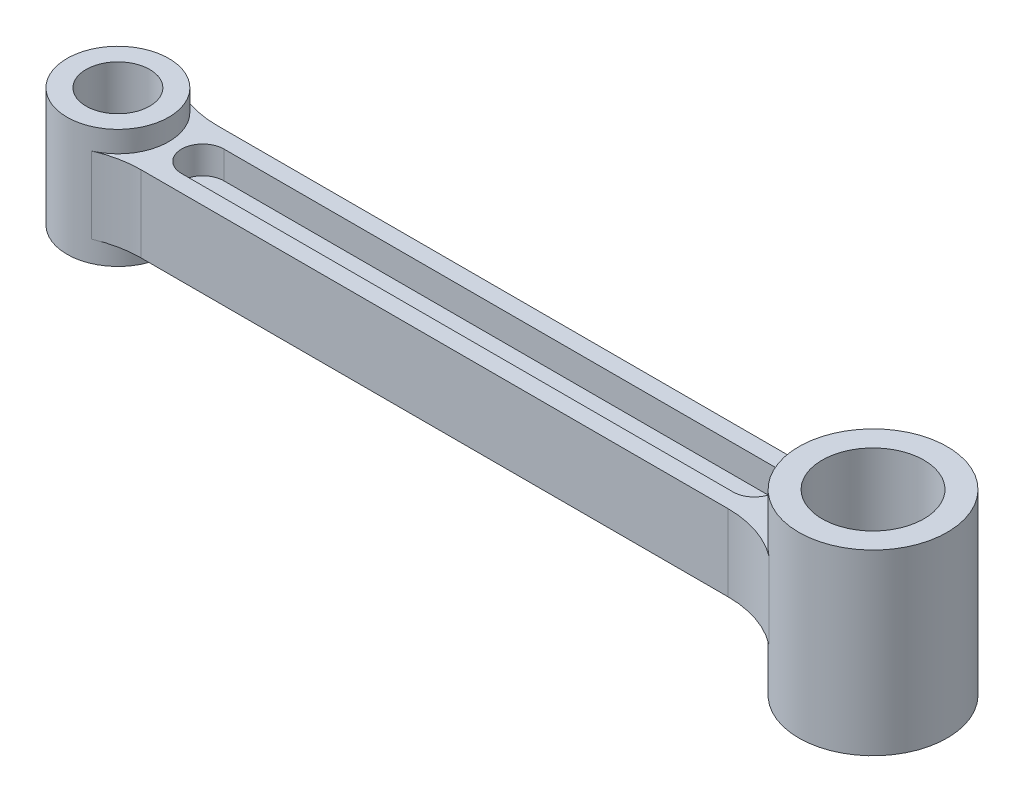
ISO-10303-21;
HEADER;
FILE_DESCRIPTION(('STEP AP214'),'2;1');
FILE_NAME('part.step','',(''),(''),'','','');
FILE_SCHEMA(('AUTOMOTIVE_DESIGN { 1 0 10303 214 1 1 1 1 }'));
ENDSEC;
DATA;
#1=APPLICATION_CONTEXT('core data for automotive mechanical design processes');
#2=APPLICATION_PROTOCOL_DEFINITION('international standard','automotive_design',2000,#1);
#3=PRODUCT_CONTEXT('',#1,'mechanical');
#4=PRODUCT('Part','Part','',(#3));
#5=PRODUCT_RELATED_PRODUCT_CATEGORY('part','',(#4));
#6=PRODUCT_DEFINITION_FORMATION('','',#4);
#7=PRODUCT_DEFINITION_CONTEXT('part definition',#1,'design');
#8=PRODUCT_DEFINITION('design','',#6,#7);
#9=PRODUCT_DEFINITION_SHAPE('','',#8);
#10=(LENGTH_UNIT() NAMED_UNIT(*) SI_UNIT(.MILLI.,.METRE.));
#11=(NAMED_UNIT(*) PLANE_ANGLE_UNIT() SI_UNIT($,.RADIAN.));
#12=(NAMED_UNIT(*) SI_UNIT($,.STERADIAN.) SOLID_ANGLE_UNIT());
#13=UNCERTAINTY_MEASURE_WITH_UNIT(LENGTH_MEASURE(1.E-05),#10,'distance_accuracy_value','');
#14=(GEOMETRIC_REPRESENTATION_CONTEXT(3) GLOBAL_UNCERTAINTY_ASSIGNED_CONTEXT((#13)) GLOBAL_UNIT_ASSIGNED_CONTEXT((#10,
#11,#12)) REPRESENTATION_CONTEXT('',''));
#15=CARTESIAN_POINT('',(0.,0.,0.));
#16=DIRECTION('',(0.,0.,1.));
#17=DIRECTION('',(1.,0.,0.));
#18=AXIS2_PLACEMENT_3D('',#15,#16,#17);
#19=CARTESIAN_POINT('',(-250.06840889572,-9.,0.));
#20=DIRECTION('',(0.,1.,0.));
#21=DIRECTION('',(0.,0.,1.));
#22=AXIS2_PLACEMENT_3D('',#19,#20,#21);
#23=PLANE('',#22);
#24=CARTESIAN_POINT('',(0.,-9.,0.));
#25=DIRECTION('',(0.,1.,0.));
#26=DIRECTION('',(0.,0.,1.));
#27=AXIS2_PLACEMENT_3D('',#24,#25,#26);
#28=CIRCLE('',#27,17.5);
#29=CARTESIAN_POINT('',(-10.6115188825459,-9.,-13.9156626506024));
#30=VERTEX_POINT('',#29);
#31=CARTESIAN_POINT('',(-10.6115188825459,-9.,13.9156626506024));
#32=VERTEX_POINT('',#31);
#33=EDGE_CURVE('E230',#30,#32,#28,.T.);
#34=ORIENTED_EDGE('',*,*,#33,.T.);
#35=CARTESIAN_POINT('',(-25.1644590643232,-9.,33.));
#36=DIRECTION('',(0.,1.,0.));
#37=DIRECTION('',(0.,0.,1.));
#38=AXIS2_PLACEMENT_3D('',#35,#36,#37);
#39=CIRCLE('',#38,24.);
#40=CARTESIAN_POINT('',(-25.1644590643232,-9.,9.));
#41=VERTEX_POINT('',#40);
#42=EDGE_CURVE('E295',#32,#41,#39,.T.);
#43=ORIENTED_EDGE('',*,*,#42,.T.);
#44=DIRECTION('',(1.,0.,0.));
#45=VECTOR('',#44,1.);
#46=CARTESIAN_POINT('',(-250.06840889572,-9.,8.99999999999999));
#47=LINE('',#46,#45);
#48=CARTESIAN_POINT('',(-163.612505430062,-9.,9.));
#49=VERTEX_POINT('',#48);
#50=EDGE_CURVE('E238',#49,#41,#47,.T.);
#51=ORIENTED_EDGE('',*,*,#50,.F.);
#52=CARTESIAN_POINT('',(-163.612505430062,-9.,33.));
#53=DIRECTION('',(0.,1.,0.));
#54=DIRECTION('',(0.,0.,1.));
#55=AXIS2_PLACEMENT_3D('',#52,#53,#54);
#56=CIRCLE('',#55,24.);
#57=CARTESIAN_POINT('',(-173.204168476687,-9.,11.));
#58=VERTEX_POINT('',#57);
#59=EDGE_CURVE('E44',#49,#58,#56,.T.);
#60=ORIENTED_EDGE('',*,*,#59,.T.);
#61=CARTESIAN_POINT('',(-178.,-9.,0.));
#62=DIRECTION('',(0.,1.,0.));
#63=DIRECTION('',(0.,0.,1.));
#64=AXIS2_PLACEMENT_3D('',#61,#62,#63);
#65=CIRCLE('',#64,12.);
#66=CARTESIAN_POINT('',(-173.204168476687,-9.,-11.));
#67=VERTEX_POINT('',#66);
#68=EDGE_CURVE('E250',#58,#67,#65,.T.);
#69=ORIENTED_EDGE('',*,*,#68,.T.);
#70=CARTESIAN_POINT('',(-163.612505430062,-9.,-33.));
#71=DIRECTION('',(0.,1.,0.));
#72=DIRECTION('',(0.,0.,1.));
#73=AXIS2_PLACEMENT_3D('',#70,#71,#72);
#74=CIRCLE('',#73,24.);
#75=CARTESIAN_POINT('',(-163.612505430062,-9.,-9.));
#76=VERTEX_POINT('',#75);
#77=EDGE_CURVE('E290',#67,#76,#74,.T.);
#78=ORIENTED_EDGE('',*,*,#77,.T.);
#79=DIRECTION('',(1.,0.,0.));
#80=VECTOR('',#79,1.);
#81=CARTESIAN_POINT('',(-250.06840889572,-9.,-8.99999999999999));
#82=LINE('',#81,#80);
#83=CARTESIAN_POINT('',(-25.1644590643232,-9.,-9.));
#84=VERTEX_POINT('',#83);
#85=EDGE_CURVE('E247',#76,#84,#82,.T.);
#86=ORIENTED_EDGE('',*,*,#85,.T.);
#87=CARTESIAN_POINT('',(-25.1644590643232,-9.,-33.));
#88=DIRECTION('',(0.,1.,0.));
#89=DIRECTION('',(0.,0.,1.));
#90=AXIS2_PLACEMENT_3D('',#87,#88,#89);
#91=CIRCLE('',#90,24.);
#92=EDGE_CURVE('E285',#84,#30,#91,.T.);
#93=ORIENTED_EDGE('',*,*,#92,.T.);
#94=EDGE_LOOP('',(#34,#43,#51,#60,#69,#78,#86,#93));
#95=FACE_BOUND('',#94,.T.);
#96=CARTESIAN_POINT('',(-158.,-9.,0.));
#97=DIRECTION('',(0.,1.,0.));
#98=DIRECTION('',(0.,0.,1.));
#99=AXIS2_PLACEMENT_3D('',#96,#97,#98);
#100=CIRCLE('',#99,5.);
#101=CARTESIAN_POINT('',(-158.,-9.,-5.));
#102=VERTEX_POINT('',#101);
#103=CARTESIAN_POINT('',(-158.,-9.,5.));
#104=VERTEX_POINT('',#103);
#105=EDGE_CURVE('E168',#102,#104,#100,.T.);
#106=ORIENTED_EDGE('',*,*,#105,.T.);
#107=DIRECTION('',(1.,0.,0.));
#108=VECTOR('',#107,1.);
#109=CARTESIAN_POINT('',(-158.,-9.,5.));
#110=LINE('',#109,#108);
#111=CARTESIAN_POINT('',(-28.,-9.,5.));
#112=VERTEX_POINT('',#111);
#113=EDGE_CURVE('E172',#104,#112,#110,.T.);
#114=ORIENTED_EDGE('',*,*,#113,.T.);
#115=CARTESIAN_POINT('',(-28.,-9.,0.));
#116=DIRECTION('',(0.,1.,0.));
#117=DIRECTION('',(0.,0.,1.));
#118=AXIS2_PLACEMENT_3D('',#115,#116,#117);
#119=CIRCLE('',#118,5.);
#120=CARTESIAN_POINT('',(-28.,-9.,-5.));
#121=VERTEX_POINT('',#120);
#122=EDGE_CURVE('E175',#112,#121,#119,.T.);
#123=ORIENTED_EDGE('',*,*,#122,.T.);
#124=DIRECTION('',(-1.,0.,0.));
#125=VECTOR('',#124,1.);
#126=CARTESIAN_POINT('',(-158.,-9.,-5.));
#127=LINE('',#126,#125);
#128=EDGE_CURVE('E181',#121,#102,#127,.T.);
#129=ORIENTED_EDGE('',*,*,#128,.T.);
#130=EDGE_LOOP('',(#106,#114,#123,#129));
#131=FACE_BOUND('',#130,.T.);
#132=ADVANCED_FACE('F36',(#95,#131),#23,.F.);
#133=CARTESIAN_POINT('',(-178.,14.,0.));
#134=DIRECTION('',(0.,-1.,0.));
#135=DIRECTION('',(0.,0.,-1.));
#136=AXIS2_PLACEMENT_3D('',#133,#134,#135);
#137=CYLINDRICAL_SURFACE('',#136,12.);
#138=DIRECTION('',(0.,-1.,0.));
#139=VECTOR('',#138,1.);
#140=CARTESIAN_POINT('',(-173.204168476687,14.,-11.));
#141=LINE('',#140,#139);
#142=CARTESIAN_POINT('',(-173.204168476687,9.,-11.));
#143=VERTEX_POINT('',#142);
#144=EDGE_CURVE('E278',#143,#67,#141,.T.);
#145=ORIENTED_EDGE('',*,*,#144,.T.);
#146=ORIENTED_EDGE('',*,*,#68,.F.);
#147=DIRECTION('',(0.,-1.,0.));
#148=VECTOR('',#147,1.);
#149=CARTESIAN_POINT('',(-173.204168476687,14.,11.));
#150=LINE('',#149,#148);
#151=CARTESIAN_POINT('',(-173.204168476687,9.,11.));
#152=VERTEX_POINT('',#151);
#153=EDGE_CURVE('E275',#58,#152,#150,.F.);
#154=ORIENTED_EDGE('',*,*,#153,.T.);
#155=CARTESIAN_POINT('',(-178.,9.,0.));
#156=DIRECTION('',(0.,1.,0.));
#157=DIRECTION('',(0.,0.,1.));
#158=AXIS2_PLACEMENT_3D('',#155,#156,#157);
#159=CIRCLE('',#158,12.);
#160=EDGE_CURVE('E241',#152,#143,#159,.T.);
#161=ORIENTED_EDGE('',*,*,#160,.T.);
#162=EDGE_LOOP('',(#145,#146,#154,#161));
#163=FACE_BOUND('',#162,.T.);
#164=CARTESIAN_POINT('',(-178.,14.,0.));
#165=DIRECTION('',(0.,1.,0.));
#166=DIRECTION('',(0.,0.,1.));
#167=AXIS2_PLACEMENT_3D('',#164,#165,#166);
#168=CIRCLE('',#167,12.);
#169=CARTESIAN_POINT('',(-178.,14.,12.));
#170=VERTEX_POINT('',#169);
#171=EDGE_CURVE('E253',#170,#170,#168,.T.);
#172=ORIENTED_EDGE('',*,*,#171,.F.);
#173=EDGE_LOOP('',(#172));
#174=FACE_BOUND('',#173,.T.);
#175=CARTESIAN_POINT('',(-178.,-14.,0.));
#176=DIRECTION('',(0.,1.,0.));
#177=DIRECTION('',(0.,0.,1.));
#178=AXIS2_PLACEMENT_3D('',#175,#176,#177);
#179=CIRCLE('',#178,12.);
#180=CARTESIAN_POINT('',(-178.,-14.,12.));
#181=VERTEX_POINT('',#180);
#182=EDGE_CURVE('E245',#181,#181,#179,.T.);
#183=ORIENTED_EDGE('',*,*,#182,.T.);
#184=EDGE_LOOP('',(#183));
#185=FACE_BOUND('',#184,.T.);
#186=ADVANCED_FACE('F308',(#163,#174,#185),#137,.T.);
#187=CARTESIAN_POINT('',(-178.,14.,0.));
#188=DIRECTION('',(0.,-1.,0.));
#189=DIRECTION('',(0.,0.,-1.));
#190=AXIS2_PLACEMENT_3D('',#187,#188,#189);
#191=CYLINDRICAL_SURFACE('',#190,7.50000000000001);
#192=CARTESIAN_POINT('',(-178.,14.,0.));
#193=DIRECTION('',(0.,1.,0.));
#194=DIRECTION('',(0.,0.,1.));
#195=AXIS2_PLACEMENT_3D('',#192,#193,#194);
#196=CIRCLE('',#195,7.50000000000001);
#197=CARTESIAN_POINT('',(-178.,14.,7.50000000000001));
#198=VERTEX_POINT('',#197);
#199=EDGE_CURVE('E256',#198,#198,#196,.T.);
#200=ORIENTED_EDGE('',*,*,#199,.T.);
#201=EDGE_LOOP('',(#200));
#202=FACE_BOUND('',#201,.T.);
#203=CARTESIAN_POINT('',(-178.,-14.,0.));
#204=DIRECTION('',(0.,1.,0.));
#205=DIRECTION('',(0.,0.,1.));
#206=AXIS2_PLACEMENT_3D('',#203,#204,#205);
#207=CIRCLE('',#206,7.50000000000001);
#208=CARTESIAN_POINT('',(-178.,-14.,7.50000000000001));
#209=VERTEX_POINT('',#208);
#210=EDGE_CURVE('E257',#209,#209,#207,.T.);
#211=ORIENTED_EDGE('',*,*,#210,.F.);
#212=EDGE_LOOP('',(#211));
#213=FACE_BOUND('',#212,.T.);
#214=ADVANCED_FACE('F350',(#202,#213),#191,.F.);
#215=CARTESIAN_POINT('',(-250.06840889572,14.,0.));
#216=DIRECTION('',(0.,1.,0.));
#217=DIRECTION('',(0.,0.,1.));
#218=AXIS2_PLACEMENT_3D('',#215,#216,#217);
#219=PLANE('',#218);
#220=ORIENTED_EDGE('',*,*,#171,.T.);
#221=EDGE_LOOP('',(#220));
#222=FACE_BOUND('',#221,.T.);
#223=ORIENTED_EDGE('',*,*,#199,.F.);
#224=EDGE_LOOP('',(#223));
#225=FACE_BOUND('',#224,.T.);
#226=ADVANCED_FACE('F549',(#222,#225),#219,.T.);
#227=CARTESIAN_POINT('',(-250.06840889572,-14.,0.));
#228=DIRECTION('',(0.,1.,0.));
#229=DIRECTION('',(0.,0.,1.));
#230=AXIS2_PLACEMENT_3D('',#227,#228,#229);
#231=PLANE('',#230);
#232=ORIENTED_EDGE('',*,*,#182,.F.);
#233=EDGE_LOOP('',(#232));
#234=FACE_BOUND('',#233,.T.);
#235=ORIENTED_EDGE('',*,*,#210,.T.);
#236=EDGE_LOOP('',(#235));
#237=FACE_BOUND('',#236,.T.);
#238=ADVANCED_FACE('F343',(#234,#237),#231,.F.);
#239=CARTESIAN_POINT('',(-250.06840889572,9.,-8.99999999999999));
#240=DIRECTION('',(0.,0.,-1.));
#241=DIRECTION('',(-1.,0.,0.));
#242=AXIS2_PLACEMENT_3D('',#239,#240,#241);
#243=PLANE('',#242);
#244=DIRECTION('',(1.,0.,0.));
#245=VECTOR('',#244,1.);
#246=CARTESIAN_POINT('',(-250.06840889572,9.,-8.99999999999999));
#247=LINE('',#246,#245);
#248=CARTESIAN_POINT('',(-163.612505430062,9.,-9.));
#249=VERTEX_POINT('',#248);
#250=CARTESIAN_POINT('',(-25.1644590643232,9.,-9.));
#251=VERTEX_POINT('',#250);
#252=EDGE_CURVE('E237',#249,#251,#247,.T.);
#253=ORIENTED_EDGE('',*,*,#252,.T.);
#254=DIRECTION('',(0.,-1.,0.));
#255=VECTOR('',#254,1.);
#256=CARTESIAN_POINT('',(-25.1644590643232,9.,-9.));
#257=LINE('',#256,#255);
#258=EDGE_CURVE('E266',#251,#84,#257,.T.);
#259=ORIENTED_EDGE('',*,*,#258,.T.);
#260=ORIENTED_EDGE('',*,*,#85,.F.);
#261=DIRECTION('',(0.,-1.,0.));
#262=VECTOR('',#261,1.);
#263=CARTESIAN_POINT('',(-163.612505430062,9.,-9.));
#264=LINE('',#263,#262);
#265=EDGE_CURVE('E260',#76,#249,#264,.F.);
#266=ORIENTED_EDGE('',*,*,#265,.T.);
#267=EDGE_LOOP('',(#253,#259,#260,#266));
#268=FACE_BOUND('',#267,.T.);
#269=ADVANCED_FACE('F317',(#268),#243,.T.);
#270=CARTESIAN_POINT('',(-250.06840889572,9.,8.99999999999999));
#271=DIRECTION('',(0.,0.,-1.));
#272=DIRECTION('',(-1.,0.,0.));
#273=AXIS2_PLACEMENT_3D('',#270,#271,#272);
#274=PLANE('',#273);
#275=ORIENTED_EDGE('',*,*,#50,.T.);
#276=DIRECTION('',(0.,1.,0.));
#277=VECTOR('',#276,1.);
#278=CARTESIAN_POINT('',(-25.1644590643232,9.,9.));
#279=LINE('',#278,#277);
#280=CARTESIAN_POINT('',(-25.1644590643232,9.,9.));
#281=VERTEX_POINT('',#280);
#282=EDGE_CURVE('E51',#41,#281,#279,.T.);
#283=ORIENTED_EDGE('',*,*,#282,.T.);
#284=DIRECTION('',(1.,0.,0.));
#285=VECTOR('',#284,1.);
#286=CARTESIAN_POINT('',(-250.06840889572,9.,8.99999999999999));
#287=LINE('',#286,#285);
#288=CARTESIAN_POINT('',(-163.612505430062,9.,9.));
#289=VERTEX_POINT('',#288);
#290=EDGE_CURVE('E243',#289,#281,#287,.T.);
#291=ORIENTED_EDGE('',*,*,#290,.F.);
#292=DIRECTION('',(0.,1.,0.));
#293=VECTOR('',#292,1.);
#294=CARTESIAN_POINT('',(-163.612505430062,-9.,9.));
#295=LINE('',#294,#293);
#296=EDGE_CURVE('E281',#289,#49,#295,.F.);
#297=ORIENTED_EDGE('',*,*,#296,.T.);
#298=EDGE_LOOP('',(#275,#283,#291,#297));
#299=FACE_BOUND('',#298,.T.);
#300=ADVANCED_FACE('F333',(#299),#274,.F.);
#301=CARTESIAN_POINT('',(-250.06840889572,9.,0.));
#302=DIRECTION('',(0.,1.,0.));
#303=DIRECTION('',(0.,0.,1.));
#304=AXIS2_PLACEMENT_3D('',#301,#302,#303);
#305=PLANE('',#304);
#306=CARTESIAN_POINT('',(-158.,9.,0.));
#307=DIRECTION('',(0.,1.,0.));
#308=DIRECTION('',(0.,0.,1.));
#309=AXIS2_PLACEMENT_3D('',#306,#307,#308);
#310=CIRCLE('',#309,5.);
#311=CARTESIAN_POINT('',(-158.,9.,-5.));
#312=VERTEX_POINT('',#311);
#313=CARTESIAN_POINT('',(-158.,9.,5.));
#314=VERTEX_POINT('',#313);
#315=EDGE_CURVE('E187',#312,#314,#310,.T.);
#316=ORIENTED_EDGE('',*,*,#315,.F.);
#317=DIRECTION('',(-1.,0.,0.));
#318=VECTOR('',#317,1.);
#319=CARTESIAN_POINT('',(-158.,9.,-5.));
#320=LINE('',#319,#318);
#321=CARTESIAN_POINT('',(-28.,9.,-5.));
#322=VERTEX_POINT('',#321);
#323=EDGE_CURVE('E195',#322,#312,#320,.T.);
#324=ORIENTED_EDGE('',*,*,#323,.F.);
#325=CARTESIAN_POINT('',(-28.,9.,0.));
#326=DIRECTION('',(0.,1.,0.));
#327=DIRECTION('',(0.,0.,1.));
#328=AXIS2_PLACEMENT_3D('',#325,#326,#327);
#329=CIRCLE('',#328,5.);
#330=CARTESIAN_POINT('',(-28.,9.,5.));
#331=VERTEX_POINT('',#330);
#332=EDGE_CURVE('E209',#331,#322,#329,.T.);
#333=ORIENTED_EDGE('',*,*,#332,.F.);
#334=DIRECTION('',(1.,0.,0.));
#335=VECTOR('',#334,1.);
#336=CARTESIAN_POINT('',(-158.,9.,5.));
#337=LINE('',#336,#335);
#338=EDGE_CURVE('E206',#314,#331,#337,.T.);
#339=ORIENTED_EDGE('',*,*,#338,.F.);
#340=EDGE_LOOP('',(#316,#324,#333,#339));
#341=FACE_BOUND('',#340,.T.);
#342=CARTESIAN_POINT('',(0.,9.,0.));
#343=DIRECTION('',(0.,1.,0.));
#344=DIRECTION('',(0.,0.,1.));
#345=AXIS2_PLACEMENT_3D('',#342,#343,#344);
#346=CIRCLE('',#345,17.5);
#347=CARTESIAN_POINT('',(-10.6115188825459,9.,-13.9156626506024));
#348=VERTEX_POINT('',#347);
#349=CARTESIAN_POINT('',(-10.6115188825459,9.,13.9156626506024));
#350=VERTEX_POINT('',#349);
#351=EDGE_CURVE('E235',#348,#350,#346,.T.);
#352=ORIENTED_EDGE('',*,*,#351,.F.);
#353=CARTESIAN_POINT('',(-25.1644590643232,9.,-33.));
#354=DIRECTION('',(0.,1.,0.));
#355=DIRECTION('',(0.,0.,1.));
#356=AXIS2_PLACEMENT_3D('',#353,#354,#355);
#357=CIRCLE('',#356,24.);
#358=EDGE_CURVE('E288',#348,#251,#357,.F.);
#359=ORIENTED_EDGE('',*,*,#358,.T.);
#360=ORIENTED_EDGE('',*,*,#252,.F.);
#361=CARTESIAN_POINT('',(-163.612505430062,9.,-33.));
#362=DIRECTION('',(0.,1.,0.));
#363=DIRECTION('',(0.,0.,1.));
#364=AXIS2_PLACEMENT_3D('',#361,#362,#363);
#365=CIRCLE('',#364,24.);
#366=EDGE_CURVE('E292',#249,#143,#365,.F.);
#367=ORIENTED_EDGE('',*,*,#366,.T.);
#368=ORIENTED_EDGE('',*,*,#160,.F.);
#369=CARTESIAN_POINT('',(-163.612505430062,9.,33.));
#370=DIRECTION('',(0.,1.,0.));
#371=DIRECTION('',(0.,0.,1.));
#372=AXIS2_PLACEMENT_3D('',#369,#370,#371);
#373=CIRCLE('',#372,24.);
#374=EDGE_CURVE('E11',#152,#289,#373,.F.);
#375=ORIENTED_EDGE('',*,*,#374,.T.);
#376=ORIENTED_EDGE('',*,*,#290,.T.);
#377=CARTESIAN_POINT('',(-25.1644590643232,9.,33.));
#378=DIRECTION('',(0.,1.,0.));
#379=DIRECTION('',(0.,0.,1.));
#380=AXIS2_PLACEMENT_3D('',#377,#378,#379);
#381=CIRCLE('',#380,24.);
#382=EDGE_CURVE('E297',#281,#350,#381,.F.);
#383=ORIENTED_EDGE('',*,*,#382,.T.);
#384=EDGE_LOOP('',(#352,#359,#360,#367,#368,#375,#376,#383));
#385=FACE_BOUND('',#384,.T.);
#386=ADVANCED_FACE('F332',(#341,#385),#305,.T.);
#387=CARTESIAN_POINT('',(0.,21.,0.));
#388=DIRECTION('',(0.,-1.,0.));
#389=DIRECTION('',(0.,0.,-1.));
#390=AXIS2_PLACEMENT_3D('',#387,#388,#389);
#391=CYLINDRICAL_SURFACE('',#390,12.);
#392=CARTESIAN_POINT('',(0.,21.,0.));
#393=DIRECTION('',(0.,1.,0.));
#394=DIRECTION('',(0.,0.,1.));
#395=AXIS2_PLACEMENT_3D('',#392,#393,#394);
#396=CIRCLE('',#395,12.);
#397=CARTESIAN_POINT('',(0.,21.,-12.));
#398=VERTEX_POINT('',#397);
#399=EDGE_CURVE('E223',#398,#398,#396,.T.);
#400=CARTESIAN_POINT('',(0.,-21.,0.));
#401=DIRECTION('',(0.,1.,0.));
#402=DIRECTION('',(0.,0.,1.));
#403=AXIS2_PLACEMENT_3D('',#400,#401,#402);
#404=CIRCLE('',#403,12.);
#405=CARTESIAN_POINT('',(0.,-21.,-12.));
#406=VERTEX_POINT('',#405);
#407=EDGE_CURVE('E216',#406,#406,#404,.T.);
#408=CARTESIAN_POINT('',(0.,21.,-12.));
#409=CARTESIAN_POINT('',(0.,20.5625,-12.));
#410=CARTESIAN_POINT('',(0.,20.125,-12.));
#411=CARTESIAN_POINT('',(0.,19.25,-12.));
#412=CARTESIAN_POINT('',(0.,18.8125,-12.));
#413=CARTESIAN_POINT('',(0.,17.9375,-12.));
#414=CARTESIAN_POINT('',(0.,17.5,-12.));
#415=CARTESIAN_POINT('',(0.,16.625,-12.));
#416=CARTESIAN_POINT('',(0.,16.1875,-12.));
#417=CARTESIAN_POINT('',(0.,15.3125,-12.));
#418=CARTESIAN_POINT('',(0.,14.875,-12.));
#419=CARTESIAN_POINT('',(0.,14.,-12.));
#420=CARTESIAN_POINT('',(0.,13.5625,-12.));
#421=CARTESIAN_POINT('',(0.,12.6875,-12.));
#422=CARTESIAN_POINT('',(0.,12.25,-12.));
#423=CARTESIAN_POINT('',(0.,11.375,-12.));
#424=CARTESIAN_POINT('',(0.,10.9375,-12.));
#425=CARTESIAN_POINT('',(0.,10.0625,-12.));
#426=CARTESIAN_POINT('',(0.,9.625,-12.));
#427=CARTESIAN_POINT('',(0.,8.75,-12.));
#428=CARTESIAN_POINT('',(0.,8.3125,-12.));
#429=CARTESIAN_POINT('',(0.,7.4375,-12.));
#430=CARTESIAN_POINT('',(0.,7.,-12.));
#431=CARTESIAN_POINT('',(0.,6.125,-12.));
#432=CARTESIAN_POINT('',(0.,5.6875,-12.));
#433=CARTESIAN_POINT('',(0.,4.8125,-12.));
#434=CARTESIAN_POINT('',(0.,4.375,-12.));
#435=CARTESIAN_POINT('',(0.,3.5,-12.));
#436=CARTESIAN_POINT('',(0.,3.0625,-12.));
#437=CARTESIAN_POINT('',(0.,2.1875,-12.));
#438=CARTESIAN_POINT('',(0.,1.75,-12.));
#439=CARTESIAN_POINT('',(0.,0.874999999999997,-12.));
#440=CARTESIAN_POINT('',(0.,0.437499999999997,-12.));
#441=CARTESIAN_POINT('',(0.,-0.437500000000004,-12.));
#442=CARTESIAN_POINT('',(0.,-0.875000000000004,-12.));
#443=CARTESIAN_POINT('',(0.,-1.75000000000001,-12.));
#444=CARTESIAN_POINT('',(0.,-2.18750000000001,-12.));
#445=CARTESIAN_POINT('',(0.,-3.0625,-12.));
#446=CARTESIAN_POINT('',(0.,-3.5,-12.));
#447=CARTESIAN_POINT('',(0.,-4.375,-12.));
#448=CARTESIAN_POINT('',(0.,-4.8125,-12.));
#449=CARTESIAN_POINT('',(0.,-5.68750000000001,-12.));
#450=CARTESIAN_POINT('',(0.,-6.12500000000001,-12.));
#451=CARTESIAN_POINT('',(0.,-7.00000000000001,-12.));
#452=CARTESIAN_POINT('',(0.,-7.4375,-12.));
#453=CARTESIAN_POINT('',(0.,-8.3125,-12.));
#454=CARTESIAN_POINT('',(0.,-8.75,-12.));
#455=CARTESIAN_POINT('',(0.,-9.625,-12.));
#456=CARTESIAN_POINT('',(0.,-10.0625,-12.));
#457=CARTESIAN_POINT('',(0.,-10.9375,-12.));
#458=CARTESIAN_POINT('',(0.,-11.375,-12.));
#459=CARTESIAN_POINT('',(0.,-12.25,-12.));
#460=CARTESIAN_POINT('',(0.,-12.6875,-12.));
#461=CARTESIAN_POINT('',(0.,-13.5625,-12.));
#462=CARTESIAN_POINT('',(0.,-14.,-12.));
#463=CARTESIAN_POINT('',(0.,-14.875,-12.));
#464=CARTESIAN_POINT('',(0.,-15.3125,-12.));
#465=CARTESIAN_POINT('',(0.,-16.1875,-12.));
#466=CARTESIAN_POINT('',(0.,-16.625,-12.));
#467=CARTESIAN_POINT('',(0.,-17.5,-12.));
#468=CARTESIAN_POINT('',(0.,-17.9375,-12.));
#469=CARTESIAN_POINT('',(0.,-18.8125,-12.));
#470=CARTESIAN_POINT('',(0.,-19.25,-12.));
#471=CARTESIAN_POINT('',(0.,-20.125,-12.));
#472=CARTESIAN_POINT('',(0.,-20.5625,-12.));
#473=CARTESIAN_POINT('',(0.,-21.,-12.));
#474=B_SPLINE_CURVE_WITH_KNOTS('',3,(#408,#409,#410,#411,#412,#413,#414,#415,#416,#417,#418,
#419,#420,#421,#422,#423,#424,#425,#426,#427,#428,#429,#430,#431,#432,#433,#434,#435,#436,#437,
#438,#439,#440,#441,#442,#443,#444,#445,#446,#447,#448,#449,#450,#451,#452,#453,#454,#455,#456,
#457,#458,#459,#460,#461,#462,#463,#464,#465,#466,#467,#468,#469,#470,#471,#472,#473),
.UNSPECIFIED.,.F.,.F.,(4,2,2,2,2,2,2,2,2,2,2,2,2,2,2,2,2,2,2,2,2,2,2,2,2,2,2,2,2,2,2,2,4),(0.,
1.3125,2.625,3.9375,5.25,6.5625,7.875,9.1875,10.5,11.8125,13.125,14.4375,15.75,17.0625,18.375,
19.6875,21.,22.3125,23.625,24.9375,26.25,27.5625,28.875,30.1875,31.5,32.8125,34.125,35.4375,
36.75,38.0625,39.375,40.6875,42.),.UNSPECIFIED.);
#475=EDGE_CURVE('BSEAM340',#398,#406,#474,.T.);
#476=ORIENTED_EDGE('',*,*,#399,.T.);
#477=ORIENTED_EDGE('',*,*,#407,.F.);
#478=ORIENTED_EDGE('',*,*,#475,.T.);
#479=ORIENTED_EDGE('',*,*,#475,.F.);
#480=EDGE_LOOP('',(#476,#478,#477,#479));
#481=FACE_BOUND('',#480,.T.);
#482=ADVANCED_FACE('F340',(#481),#391,.F.);
#483=CARTESIAN_POINT('',(0.,21.,0.));
#484=DIRECTION('',(0.,-1.,0.));
#485=DIRECTION('',(0.,0.,-1.));
#486=AXIS2_PLACEMENT_3D('',#483,#484,#485);
#487=CYLINDRICAL_SURFACE('',#486,17.5);
#488=ORIENTED_EDGE('',*,*,#33,.F.);
#489=DIRECTION('',(0.,-1.,0.));
#490=VECTOR('',#489,1.);
#491=CARTESIAN_POINT('',(-10.6115188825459,21.,-13.9156626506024));
#492=LINE('',#491,#490);
#493=EDGE_CURVE('E272',#30,#348,#492,.F.);
#494=ORIENTED_EDGE('',*,*,#493,.T.);
#495=ORIENTED_EDGE('',*,*,#351,.T.);
#496=DIRECTION('',(0.,-1.,0.));
#497=VECTOR('',#496,1.);
#498=CARTESIAN_POINT('',(-10.6115188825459,21.,13.9156626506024));
#499=LINE('',#498,#497);
#500=EDGE_CURVE('E269',#350,#32,#499,.T.);
#501=ORIENTED_EDGE('',*,*,#500,.T.);
#502=EDGE_LOOP('',(#488,#494,#495,#501));
#503=FACE_BOUND('',#502,.T.);
#504=CARTESIAN_POINT('',(0.,21.,0.));
#505=DIRECTION('',(0.,1.,0.));
#506=DIRECTION('',(0.,0.,1.));
#507=AXIS2_PLACEMENT_3D('',#504,#505,#506);
#508=CIRCLE('',#507,17.5);
#509=CARTESIAN_POINT('',(0.,21.,17.5));
#510=VERTEX_POINT('',#509);
#511=EDGE_CURVE('E226',#510,#510,#508,.T.);
#512=ORIENTED_EDGE('',*,*,#511,.F.);
#513=EDGE_LOOP('',(#512));
#514=FACE_BOUND('',#513,.T.);
#515=CARTESIAN_POINT('',(0.,-21.,0.));
#516=DIRECTION('',(0.,1.,0.));
#517=DIRECTION('',(0.,0.,1.));
#518=AXIS2_PLACEMENT_3D('',#515,#516,#517);
#519=CIRCLE('',#518,17.5);
#520=CARTESIAN_POINT('',(0.,-21.,17.5));
#521=VERTEX_POINT('',#520);
#522=EDGE_CURVE('E227',#521,#521,#519,.T.);
#523=ORIENTED_EDGE('',*,*,#522,.T.);
#524=EDGE_LOOP('',(#523));
#525=FACE_BOUND('',#524,.T.);
#526=ADVANCED_FACE('F330',(#503,#514,#525),#487,.T.);
#527=CARTESIAN_POINT('',(-250.06840889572,21.,0.));
#528=DIRECTION('',(0.,1.,0.));
#529=DIRECTION('',(0.,0.,1.));
#530=AXIS2_PLACEMENT_3D('',#527,#528,#529);
#531=PLANE('',#530);
#532=ORIENTED_EDGE('',*,*,#399,.F.);
#533=EDGE_LOOP('',(#532));
#534=FACE_BOUND('',#533,.T.);
#535=ORIENTED_EDGE('',*,*,#511,.T.);
#536=EDGE_LOOP('',(#535));
#537=FACE_BOUND('',#536,.T.);
#538=ADVANCED_FACE('F358',(#534,#537),#531,.T.);
#539=CARTESIAN_POINT('',(-250.06840889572,-21.,0.));
#540=DIRECTION('',(0.,1.,0.));
#541=DIRECTION('',(0.,0.,1.));
#542=AXIS2_PLACEMENT_3D('',#539,#540,#541);
#543=PLANE('',#542);
#544=ORIENTED_EDGE('',*,*,#407,.T.);
#545=EDGE_LOOP('',(#544));
#546=FACE_BOUND('',#545,.T.);
#547=ORIENTED_EDGE('',*,*,#522,.F.);
#548=EDGE_LOOP('',(#547));
#549=FACE_BOUND('',#548,.T.);
#550=ADVANCED_FACE('F359',(#546,#549),#543,.F.);
#551=CARTESIAN_POINT('',(-158.,2.5,0.));
#552=DIRECTION('',(0.,1.,0.));
#553=DIRECTION('',(0.,0.,1.));
#554=AXIS2_PLACEMENT_3D('',#551,#552,#553);
#555=CYLINDRICAL_SURFACE('',#554,5.);
#556=ORIENTED_EDGE('',*,*,#315,.T.);
#557=DIRECTION('',(0.,1.,0.));
#558=VECTOR('',#557,1.);
#559=CARTESIAN_POINT('',(-158.,2.5,5.));
#560=LINE('',#559,#558);
#561=CARTESIAN_POINT('',(-158.,2.5,5.));
#562=VERTEX_POINT('',#561);
#563=EDGE_CURVE('E204',#562,#314,#560,.T.);
#564=ORIENTED_EDGE('',*,*,#563,.F.);
#565=CARTESIAN_POINT('',(-158.,2.5,0.));
#566=DIRECTION('',(0.,1.,0.));
#567=DIRECTION('',(0.,0.,1.));
#568=AXIS2_PLACEMENT_3D('',#565,#566,#567);
#569=CIRCLE('',#568,5.);
#570=CARTESIAN_POINT('',(-158.,2.5,-5.));
#571=VERTEX_POINT('',#570);
#572=EDGE_CURVE('E191',#571,#562,#569,.T.);
#573=ORIENTED_EDGE('',*,*,#572,.F.);
#574=DIRECTION('',(0.,1.,0.));
#575=VECTOR('',#574,1.);
#576=CARTESIAN_POINT('',(-158.,2.5,-5.));
#577=LINE('',#576,#575);
#578=EDGE_CURVE('E214',#571,#312,#577,.T.);
#579=ORIENTED_EDGE('',*,*,#578,.T.);
#580=EDGE_LOOP('',(#556,#564,#573,#579));
#581=FACE_BOUND('',#580,.T.);
#582=ADVANCED_FACE('F362',(#581),#555,.F.);
#583=CARTESIAN_POINT('',(-158.,2.5,-5.));
#584=DIRECTION('',(0.,0.,-1.));
#585=DIRECTION('',(-1.,0.,0.));
#586=AXIS2_PLACEMENT_3D('',#583,#584,#585);
#587=PLANE('',#586);
#588=ORIENTED_EDGE('',*,*,#323,.T.);
#589=ORIENTED_EDGE('',*,*,#578,.F.);
#590=DIRECTION('',(-1.,0.,0.));
#591=VECTOR('',#590,1.);
#592=CARTESIAN_POINT('',(-158.,2.5,-5.));
#593=LINE('',#592,#591);
#594=CARTESIAN_POINT('',(-28.,2.5,-5.));
#595=VERTEX_POINT('',#594);
#596=EDGE_CURVE('E201',#595,#571,#593,.T.);
#597=ORIENTED_EDGE('',*,*,#596,.F.);
#598=DIRECTION('',(0.,1.,0.));
#599=VECTOR('',#598,1.);
#600=CARTESIAN_POINT('',(-28.,2.5,-5.));
#601=LINE('',#600,#599);
#602=EDGE_CURVE('E217',#595,#322,#601,.T.);
#603=ORIENTED_EDGE('',*,*,#602,.T.);
#604=EDGE_LOOP('',(#588,#589,#597,#603));
#605=FACE_BOUND('',#604,.T.);
#606=ADVANCED_FACE('F369',(#605),#587,.F.);
#607=CARTESIAN_POINT('',(-28.,2.5,0.));
#608=DIRECTION('',(0.,1.,0.));
#609=DIRECTION('',(0.,0.,1.));
#610=AXIS2_PLACEMENT_3D('',#607,#608,#609);
#611=CYLINDRICAL_SURFACE('',#610,5.);
#612=ORIENTED_EDGE('',*,*,#332,.T.);
#613=ORIENTED_EDGE('',*,*,#602,.F.);
#614=CARTESIAN_POINT('',(-28.,2.5,0.));
#615=DIRECTION('',(0.,1.,0.));
#616=DIRECTION('',(0.,0.,1.));
#617=AXIS2_PLACEMENT_3D('',#614,#615,#616);
#618=CIRCLE('',#617,5.);
#619=CARTESIAN_POINT('',(-28.,2.5,5.));
#620=VERTEX_POINT('',#619);
#621=EDGE_CURVE('E198',#620,#595,#618,.T.);
#622=ORIENTED_EDGE('',*,*,#621,.F.);
#623=DIRECTION('',(0.,1.,0.));
#624=VECTOR('',#623,1.);
#625=CARTESIAN_POINT('',(-28.,2.5,5.));
#626=LINE('',#625,#624);
#627=EDGE_CURVE('E219',#620,#331,#626,.T.);
#628=ORIENTED_EDGE('',*,*,#627,.T.);
#629=EDGE_LOOP('',(#612,#613,#622,#628));
#630=FACE_BOUND('',#629,.T.);
#631=ADVANCED_FACE('F375',(#630),#611,.F.);
#632=CARTESIAN_POINT('',(-158.,2.5,5.));
#633=DIRECTION('',(0.,0.,1.));
#634=DIRECTION('',(1.,0.,0.));
#635=AXIS2_PLACEMENT_3D('',#632,#633,#634);
#636=PLANE('',#635);
#637=ORIENTED_EDGE('',*,*,#338,.T.);
#638=ORIENTED_EDGE('',*,*,#627,.F.);
#639=DIRECTION('',(1.,0.,0.));
#640=VECTOR('',#639,1.);
#641=CARTESIAN_POINT('',(-158.,2.5,5.));
#642=LINE('',#641,#640);
#643=EDGE_CURVE('E194',#562,#620,#642,.T.);
#644=ORIENTED_EDGE('',*,*,#643,.F.);
#645=ORIENTED_EDGE('',*,*,#563,.T.);
#646=EDGE_LOOP('',(#637,#638,#644,#645));
#647=FACE_BOUND('',#646,.T.);
#648=ADVANCED_FACE('F371',(#647),#636,.F.);
#649=CARTESIAN_POINT('',(-158.,2.5,0.));
#650=DIRECTION('',(0.,1.,0.));
#651=DIRECTION('',(0.,0.,1.));
#652=AXIS2_PLACEMENT_3D('',#649,#650,#651);
#653=PLANE('',#652);
#654=ORIENTED_EDGE('',*,*,#572,.T.);
#655=ORIENTED_EDGE('',*,*,#643,.T.);
#656=ORIENTED_EDGE('',*,*,#621,.T.);
#657=ORIENTED_EDGE('',*,*,#596,.T.);
#658=EDGE_LOOP('',(#654,#655,#656,#657));
#659=FACE_BOUND('',#658,.T.);
#660=ADVANCED_FACE('F374',(#659),#653,.T.);
#661=CARTESIAN_POINT('',(-158.,-2.5,0.));
#662=DIRECTION('',(0.,-1.,0.));
#663=DIRECTION('',(0.,0.,-1.));
#664=AXIS2_PLACEMENT_3D('',#661,#662,#663);
#665=CYLINDRICAL_SURFACE('',#664,5.);
#666=ORIENTED_EDGE('',*,*,#105,.F.);
#667=DIRECTION('',(0.,-1.,0.));
#668=VECTOR('',#667,1.);
#669=CARTESIAN_POINT('',(-158.,-2.5,-5.));
#670=LINE('',#669,#668);
#671=CARTESIAN_POINT('',(-158.,-2.5,-5.));
#672=VERTEX_POINT('',#671);
#673=EDGE_CURVE('E153',#672,#102,#670,.T.);
#674=ORIENTED_EDGE('',*,*,#673,.F.);
#675=CARTESIAN_POINT('',(-158.,-2.5,0.));
#676=DIRECTION('',(0.,1.,0.));
#677=DIRECTION('',(0.,0.,1.));
#678=AXIS2_PLACEMENT_3D('',#675,#676,#677);
#679=CIRCLE('',#678,5.);
#680=CARTESIAN_POINT('',(-158.,-2.5,5.));
#681=VERTEX_POINT('',#680);
#682=EDGE_CURVE('E160',#672,#681,#679,.T.);
#683=ORIENTED_EDGE('',*,*,#682,.T.);
#684=DIRECTION('',(0.,-1.,0.));
#685=VECTOR('',#684,1.);
#686=CARTESIAN_POINT('',(-158.,-2.5,5.));
#687=LINE('',#686,#685);
#688=EDGE_CURVE('E185',#681,#104,#687,.T.);
#689=ORIENTED_EDGE('',*,*,#688,.T.);
#690=EDGE_LOOP('',(#666,#674,#683,#689));
#691=FACE_BOUND('',#690,.T.);
#692=ADVANCED_FACE('F164',(#691),#665,.F.);
#693=CARTESIAN_POINT('',(-158.,-2.5,5.));
#694=DIRECTION('',(0.,0.,-1.));
#695=DIRECTION('',(-1.,0.,0.));
#696=AXIS2_PLACEMENT_3D('',#693,#694,#695);
#697=PLANE('',#696);
#698=ORIENTED_EDGE('',*,*,#113,.F.);
#699=ORIENTED_EDGE('',*,*,#688,.F.);
#700=DIRECTION('',(1.,0.,0.));
#701=VECTOR('',#700,1.);
#702=CARTESIAN_POINT('',(-158.,-2.5,5.));
#703=LINE('',#702,#701);
#704=CARTESIAN_POINT('',(-28.,-2.5,5.));
#705=VERTEX_POINT('',#704);
#706=EDGE_CURVE('E169',#681,#705,#703,.T.);
#707=ORIENTED_EDGE('',*,*,#706,.T.);
#708=DIRECTION('',(0.,-1.,0.));
#709=VECTOR('',#708,1.);
#710=CARTESIAN_POINT('',(-28.,-2.5,5.));
#711=LINE('',#710,#709);
#712=EDGE_CURVE('E188',#705,#112,#711,.T.);
#713=ORIENTED_EDGE('',*,*,#712,.T.);
#714=EDGE_LOOP('',(#698,#699,#707,#713));
#715=FACE_BOUND('',#714,.T.);
#716=ADVANCED_FACE('F388',(#715),#697,.T.);
#717=CARTESIAN_POINT('',(-28.,-2.5,0.));
#718=DIRECTION('',(0.,-1.,0.));
#719=DIRECTION('',(0.,0.,-1.));
#720=AXIS2_PLACEMENT_3D('',#717,#718,#719);
#721=CYLINDRICAL_SURFACE('',#720,5.);
#722=ORIENTED_EDGE('',*,*,#122,.F.);
#723=ORIENTED_EDGE('',*,*,#712,.F.);
#724=CARTESIAN_POINT('',(-28.,-2.5,0.));
#725=DIRECTION('',(0.,1.,0.));
#726=DIRECTION('',(0.,0.,1.));
#727=AXIS2_PLACEMENT_3D('',#724,#725,#726);
#728=CIRCLE('',#727,5.);
#729=CARTESIAN_POINT('',(-28.,-2.5,-5.));
#730=VERTEX_POINT('',#729);
#731=EDGE_CURVE('E159',#705,#730,#728,.T.);
#732=ORIENTED_EDGE('',*,*,#731,.T.);
#733=DIRECTION('',(0.,-1.,0.));
#734=VECTOR('',#733,1.);
#735=CARTESIAN_POINT('',(-28.,-2.5,-5.));
#736=LINE('',#735,#734);
#737=EDGE_CURVE('E155',#730,#121,#736,.T.);
#738=ORIENTED_EDGE('',*,*,#737,.T.);
#739=EDGE_LOOP('',(#722,#723,#732,#738));
#740=FACE_BOUND('',#739,.T.);
#741=ADVANCED_FACE('F391',(#740),#721,.F.);
#742=CARTESIAN_POINT('',(-158.,-2.5,-5.));
#743=DIRECTION('',(0.,0.,1.));
#744=DIRECTION('',(1.,0.,0.));
#745=AXIS2_PLACEMENT_3D('',#742,#743,#744);
#746=PLANE('',#745);
#747=ORIENTED_EDGE('',*,*,#128,.F.);
#748=ORIENTED_EDGE('',*,*,#737,.F.);
#749=DIRECTION('',(-1.,0.,0.));
#750=VECTOR('',#749,1.);
#751=CARTESIAN_POINT('',(-158.,-2.5,-5.));
#752=LINE('',#751,#750);
#753=EDGE_CURVE('E149',#730,#672,#752,.T.);
#754=ORIENTED_EDGE('',*,*,#753,.T.);
#755=ORIENTED_EDGE('',*,*,#673,.T.);
#756=EDGE_LOOP('',(#747,#748,#754,#755));
#757=FACE_BOUND('',#756,.T.);
#758=ADVANCED_FACE('F152',(#757),#746,.T.);
#759=CARTESIAN_POINT('',(-158.,-2.5,0.));
#760=DIRECTION('',(0.,-1.,0.));
#761=DIRECTION('',(0.,0.,1.));
#762=AXIS2_PLACEMENT_3D('',#759,#760,#761);
#763=PLANE('',#762);
#764=ORIENTED_EDGE('',*,*,#682,.F.);
#765=ORIENTED_EDGE('',*,*,#753,.F.);
#766=ORIENTED_EDGE('',*,*,#731,.F.);
#767=ORIENTED_EDGE('',*,*,#706,.F.);
#768=EDGE_LOOP('',(#764,#765,#766,#767));
#769=FACE_BOUND('',#768,.T.);
#770=ADVANCED_FACE('F171',(#769),#763,.T.);
#771=CARTESIAN_POINT('',(-25.1644590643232,21.,-33.));
#772=DIRECTION('',(0.,-1.,0.));
#773=DIRECTION('',(0.,0.,-1.));
#774=AXIS2_PLACEMENT_3D('',#771,#772,#773);
#775=CYLINDRICAL_SURFACE('',#774,24.);
#776=ORIENTED_EDGE('',*,*,#358,.F.);
#777=ORIENTED_EDGE('',*,*,#493,.F.);
#778=ORIENTED_EDGE('',*,*,#92,.F.);
#779=ORIENTED_EDGE('',*,*,#258,.F.);
#780=EDGE_LOOP('',(#776,#777,#778,#779));
#781=FACE_BOUND('',#780,.T.);
#782=ADVANCED_FACE('F322',(#781),#775,.F.);
#783=CARTESIAN_POINT('',(-163.612505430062,14.,-33.));
#784=DIRECTION('',(0.,-1.,0.));
#785=DIRECTION('',(0.,0.,-1.));
#786=AXIS2_PLACEMENT_3D('',#783,#784,#785);
#787=CYLINDRICAL_SURFACE('',#786,24.);
#788=ORIENTED_EDGE('',*,*,#366,.F.);
#789=ORIENTED_EDGE('',*,*,#265,.F.);
#790=ORIENTED_EDGE('',*,*,#77,.F.);
#791=ORIENTED_EDGE('',*,*,#144,.F.);
#792=EDGE_LOOP('',(#788,#789,#790,#791));
#793=FACE_BOUND('',#792,.T.);
#794=ADVANCED_FACE('F313',(#793),#787,.F.);
#795=CARTESIAN_POINT('',(-25.1644590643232,21.,33.));
#796=DIRECTION('',(0.,-1.,0.));
#797=DIRECTION('',(0.,0.,-1.));
#798=AXIS2_PLACEMENT_3D('',#795,#796,#797);
#799=CYLINDRICAL_SURFACE('',#798,24.);
#800=ORIENTED_EDGE('',*,*,#382,.F.);
#801=ORIENTED_EDGE('',*,*,#282,.F.);
#802=ORIENTED_EDGE('',*,*,#42,.F.);
#803=ORIENTED_EDGE('',*,*,#500,.F.);
#804=EDGE_LOOP('',(#800,#801,#802,#803));
#805=FACE_BOUND('',#804,.T.);
#806=ADVANCED_FACE('F329',(#805),#799,.F.);
#807=CARTESIAN_POINT('',(-163.612505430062,14.,33.));
#808=DIRECTION('',(0.,-1.,0.));
#809=DIRECTION('',(0.,0.,-1.));
#810=AXIS2_PLACEMENT_3D('',#807,#808,#809);
#811=CYLINDRICAL_SURFACE('',#810,24.);
#812=ORIENTED_EDGE('',*,*,#374,.F.);
#813=ORIENTED_EDGE('',*,*,#153,.F.);
#814=ORIENTED_EDGE('',*,*,#59,.F.);
#815=ORIENTED_EDGE('',*,*,#296,.F.);
#816=EDGE_LOOP('',(#812,#813,#814,#815));
#817=FACE_BOUND('',#816,.T.);
#818=ADVANCED_FACE('F38',(#817),#811,.F.);
#819=CLOSED_SHELL('',(#132,#186,#214,#226,#238,#269,#300,#386,#482,#526,#538,#550,#582,#606,
#631,#648,#660,#692,#716,#741,#758,#770,#782,#794,#806,#818));
#820=MANIFOLD_SOLID_BREP('B2',#819);
#821=ADVANCED_BREP_SHAPE_REPRESENTATION('',(#18,#820),#14);
#822=SHAPE_DEFINITION_REPRESENTATION(#9,#821);
ENDSEC;
END-ISO-10303-21;
